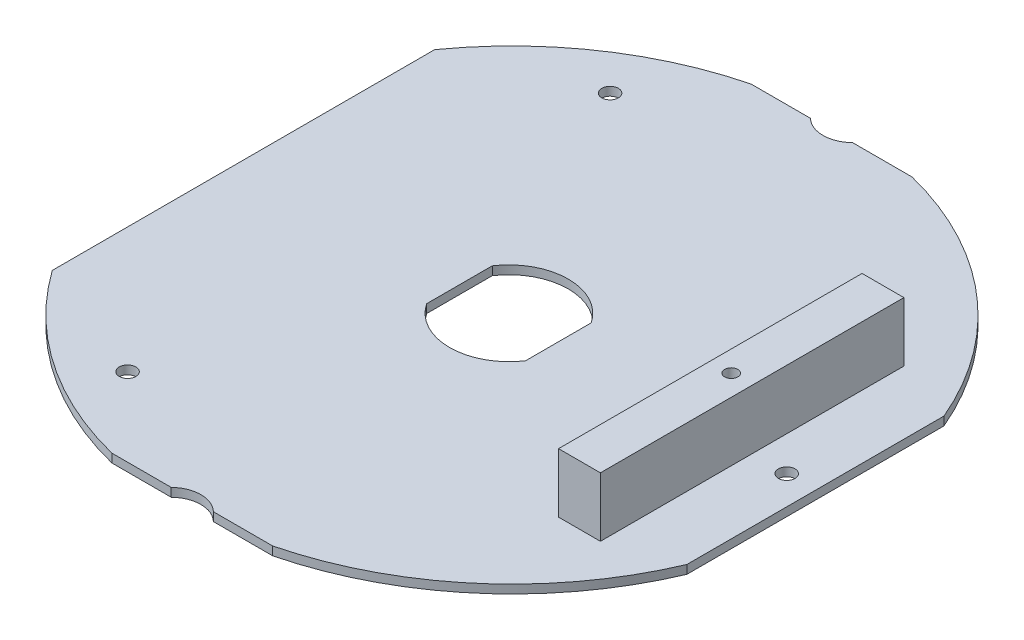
from build123d import *

# Parameters (mm, degrees)
SKETCH1_R           = 1.6002
BOSS_EXTRUDE2_DEPTH = 1.651
SKETCH2_W           = 8.0645
SKETCH2_H           = 58.4708
BOSS_EXTRUDE3_DEPTH = 11.43
SKETCH3_R           = 1.27
CUT_EXTRUDE1_DEPTH  = 2.54


with BuildPart() as part:
    # Sketch1 → Boss-Extrude2 (new body)
    with BuildSketch(Plane(origin=(0, 0, 0), x_dir=(1, 0, 0), z_dir=(0, 1, 0))):
        with BuildLine():
            Line((-51.72814611, 36.83), (-51.72814611, 0))
            Line((-51.72814611, 0), (-51.72814611, -36.83))
            ThreePointArc((-51.72814611, -36.83), (-35.816949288, -52.434684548), (-15.494, -61.580727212))
            Line((-15.494, -61.580727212), (-4.064, -61.580727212))
            ThreePointArc((-4.064, -61.580727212), (0, -59.929727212), (4.064, -61.580727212))
            Line((4.064, -61.580727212), (15.494, -61.580727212))
            ThreePointArc((15.494, -61.580727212), (41.310800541, -48.225177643), (58.471743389, -24.765))
            Line((58.471743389, -24.765), (58.471743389, 0))
            Line((58.471743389, 0), (58.471743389, 24.765))
            ThreePointArc((58.471743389, 24.765), (41.310800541, 48.225177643), (15.494, 61.580727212))
            Line((15.494, 61.580727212), (4.064, 61.580727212))
            ThreePointArc((4.064, 61.580727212), (0, 59.929727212), (-4.064, 61.580727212))
            Line((-4.064, 61.580727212), (-15.494, 61.580727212))
            ThreePointArc((-15.494, 61.580727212), (-35.816949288, 52.434684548), (-51.72814611, 36.83))
        make_face()
        with Locations(Location((-27.574642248, -46.482, 0), (0, 0, 90))):
            Circle(SKETCH1_R, mode=Mode.SUBTRACT)
        with Locations(Location((-27.574642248, 46.482, 0), (0, 0, 90))):
            Circle(SKETCH1_R, mode=Mode.SUBTRACT)
        with Locations(Location((52.934543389, 0, 0), (0, 0, 90))):
            Circle(SKETCH1_R, mode=Mode.SUBTRACT)
        with BuildLine():
            Line((8.941743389, 6.318170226), (8.941743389, -6.318170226))
            ThreePointArc((8.941743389, -6.318170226), (-0.583256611, -11.43), (-10.108256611, -6.318170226))
            Line((-10.108256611, -6.318170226), (-10.108256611, 6.318170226))
            ThreePointArc((-10.108256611, 6.318170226), (-0.583256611, 11.43), (8.941743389, 6.318170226))
        make_face(mode=Mode.SUBTRACT)
    extrude(amount=BOSS_EXTRUDE2_DEPTH)

    # Sketch2 → Boss-Extrude3 (add)
    with BuildSketch(Plane(origin=(0, 1.651, 0), x_dir=(1, 0, 0), z_dir=(0, 1, 0))):
        with Locations((42.247493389, 0)):
            Rectangle(SKETCH2_W, SKETCH2_H)
    extrude(amount=BOSS_EXTRUDE3_DEPTH)

    # Sketch3 → Cut-Extrude1 (cut)
    with BuildSketch(Plane(origin=(0, 13.081, 0), x_dir=(1, 0, 0), z_dir=(0, 1, 0))):
        with Locations(Location((42.247493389, 0, 0), (0, 0, 270))):
            Circle(SKETCH3_R)
    extrude(amount=-CUT_EXTRUDE1_DEPTH, mode=Mode.SUBTRACT)


solid = part.part
